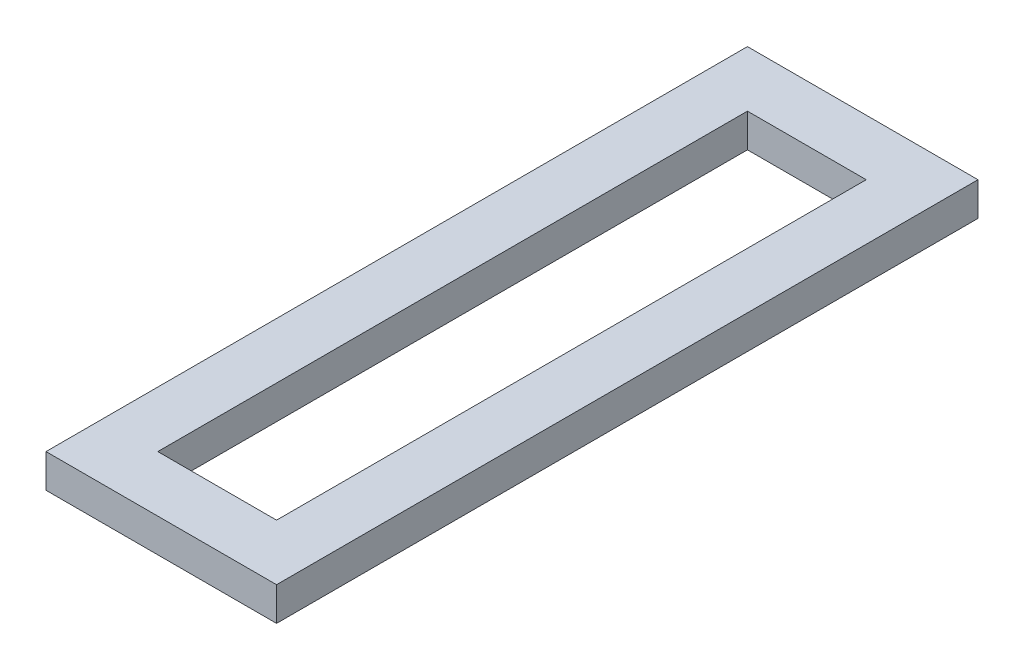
ISO-10303-21;
HEADER;
FILE_DESCRIPTION(('STEP AP214'),'2;1');
FILE_NAME('part.step','',(''),(''),'','','');
FILE_SCHEMA(('AUTOMOTIVE_DESIGN { 1 0 10303 214 1 1 1 1 }'));
ENDSEC;
DATA;
#1=APPLICATION_CONTEXT('core data for automotive mechanical design processes');
#2=APPLICATION_PROTOCOL_DEFINITION('international standard','automotive_design',2000,#1);
#3=PRODUCT_CONTEXT('',#1,'mechanical');
#4=PRODUCT('Part','Part','',(#3));
#5=PRODUCT_RELATED_PRODUCT_CATEGORY('part','',(#4));
#6=PRODUCT_DEFINITION_FORMATION('','',#4);
#7=PRODUCT_DEFINITION_CONTEXT('part definition',#1,'design');
#8=PRODUCT_DEFINITION('design','',#6,#7);
#9=PRODUCT_DEFINITION_SHAPE('','',#8);
#10=(LENGTH_UNIT() NAMED_UNIT(*) SI_UNIT(.MILLI.,.METRE.));
#11=(NAMED_UNIT(*) PLANE_ANGLE_UNIT() SI_UNIT($,.RADIAN.));
#12=(NAMED_UNIT(*) SI_UNIT($,.STERADIAN.) SOLID_ANGLE_UNIT());
#13=UNCERTAINTY_MEASURE_WITH_UNIT(LENGTH_MEASURE(1.E-05),#10,'distance_accuracy_value','');
#14=(GEOMETRIC_REPRESENTATION_CONTEXT(3) GLOBAL_UNCERTAINTY_ASSIGNED_CONTEXT((#13)) GLOBAL_UNIT_ASSIGNED_CONTEXT((#10,
#11,#12)) REPRESENTATION_CONTEXT('',''));
#15=CARTESIAN_POINT('',(0.,0.,0.));
#16=DIRECTION('',(0.,0.,1.));
#17=DIRECTION('',(1.,0.,0.));
#18=AXIS2_PLACEMENT_3D('',#15,#16,#17);
#19=CARTESIAN_POINT('',(0.,120.,0.));
#20=DIRECTION('',(0.,-1.,0.));
#21=DIRECTION('',(0.,0.,-1.));
#22=AXIS2_PLACEMENT_3D('',#19,#20,#21);
#23=PLANE('',#22);
#24=DIRECTION('',(0.,0.,-1.));
#25=VECTOR('',#24,1.);
#26=CARTESIAN_POINT('',(412.5,120.,1255.));
#27=LINE('',#26,#25);
#28=CARTESIAN_POINT('',(412.5,120.,1255.));
#29=VERTEX_POINT('',#28);
#30=CARTESIAN_POINT('',(412.5,120.,-1255.));
#31=VERTEX_POINT('',#30);
#32=EDGE_CURVE('E246',#29,#31,#27,.T.);
#33=ORIENTED_EDGE('',*,*,#32,.T.);
#34=DIRECTION('',(-1.,0.,0.));
#35=VECTOR('',#34,1.);
#36=CARTESIAN_POINT('',(-412.5,120.,-1255.));
#37=LINE('',#36,#35);
#38=CARTESIAN_POINT('',(-412.5,120.,-1255.));
#39=VERTEX_POINT('',#38);
#40=EDGE_CURVE('E249',#31,#39,#37,.T.);
#41=ORIENTED_EDGE('',*,*,#40,.T.);
#42=DIRECTION('',(0.,0.,1.));
#43=VECTOR('',#42,1.);
#44=CARTESIAN_POINT('',(-412.5,120.,1255.));
#45=LINE('',#44,#43);
#46=CARTESIAN_POINT('',(-412.5,120.,1255.));
#47=VERTEX_POINT('',#46);
#48=EDGE_CURVE('E252',#39,#47,#45,.T.);
#49=ORIENTED_EDGE('',*,*,#48,.T.);
#50=DIRECTION('',(1.,0.,0.));
#51=VECTOR('',#50,1.);
#52=CARTESIAN_POINT('',(-412.5,120.,1255.));
#53=LINE('',#52,#51);
#54=EDGE_CURVE('E254',#47,#29,#53,.T.);
#55=ORIENTED_EDGE('',*,*,#54,.T.);
#56=EDGE_LOOP('',(#33,#41,#49,#55));
#57=FACE_BOUND('',#56,.T.);
#58=DIRECTION('',(0.,0.,1.));
#59=VECTOR('',#58,1.);
#60=CARTESIAN_POINT('',(-212.5,120.,1055.));
#61=LINE('',#60,#59);
#62=CARTESIAN_POINT('',(-212.5,120.,-1055.));
#63=VERTEX_POINT('',#62);
#64=CARTESIAN_POINT('',(-212.5,120.,1055.));
#65=VERTEX_POINT('',#64);
#66=EDGE_CURVE('E220',#63,#65,#61,.T.);
#67=ORIENTED_EDGE('',*,*,#66,.F.);
#68=DIRECTION('',(-1.,0.,0.));
#69=VECTOR('',#68,1.);
#70=CARTESIAN_POINT('',(-212.5,120.,-1055.));
#71=LINE('',#70,#69);
#72=CARTESIAN_POINT('',(212.5,120.,-1055.));
#73=VERTEX_POINT('',#72);
#74=EDGE_CURVE('E227',#73,#63,#71,.T.);
#75=ORIENTED_EDGE('',*,*,#74,.F.);
#76=DIRECTION('',(0.,0.,-1.));
#77=VECTOR('',#76,1.);
#78=CARTESIAN_POINT('',(212.5,120.,1055.));
#79=LINE('',#78,#77);
#80=CARTESIAN_POINT('',(212.5,120.,1055.));
#81=VERTEX_POINT('',#80);
#82=EDGE_CURVE('E225',#81,#73,#79,.T.);
#83=ORIENTED_EDGE('',*,*,#82,.F.);
#84=DIRECTION('',(1.,0.,0.));
#85=VECTOR('',#84,1.);
#86=CARTESIAN_POINT('',(-212.5,120.,1055.));
#87=LINE('',#86,#85);
#88=EDGE_CURVE('E222',#65,#81,#87,.T.);
#89=ORIENTED_EDGE('',*,*,#88,.F.);
#90=EDGE_LOOP('',(#67,#75,#83,#89));
#91=FACE_BOUND('',#90,.T.);
#92=ADVANCED_FACE('F33',(#57,#91),#23,.F.);
#93=CARTESIAN_POINT('',(0.,0.,0.));
#94=DIRECTION('',(0.,-1.,0.));
#95=DIRECTION('',(0.,0.,-1.));
#96=AXIS2_PLACEMENT_3D('',#93,#94,#95);
#97=PLANE('',#96);
#98=DIRECTION('',(0.,0.,-1.));
#99=VECTOR('',#98,1.);
#100=CARTESIAN_POINT('',(412.5,0.,1255.));
#101=LINE('',#100,#99);
#102=CARTESIAN_POINT('',(412.5,0.,1255.));
#103=VERTEX_POINT('',#102);
#104=CARTESIAN_POINT('',(412.5,0.,-1255.));
#105=VERTEX_POINT('',#104);
#106=EDGE_CURVE('E245',#103,#105,#101,.T.);
#107=ORIENTED_EDGE('',*,*,#106,.F.);
#108=DIRECTION('',(1.,0.,0.));
#109=VECTOR('',#108,1.);
#110=CARTESIAN_POINT('',(-412.5,0.,1255.));
#111=LINE('',#110,#109);
#112=CARTESIAN_POINT('',(-412.5,0.,1255.));
#113=VERTEX_POINT('',#112);
#114=EDGE_CURVE('E250',#113,#103,#111,.T.);
#115=ORIENTED_EDGE('',*,*,#114,.F.);
#116=DIRECTION('',(0.,0.,1.));
#117=VECTOR('',#116,1.);
#118=CARTESIAN_POINT('',(-412.5,0.,1255.));
#119=LINE('',#118,#117);
#120=CARTESIAN_POINT('',(-412.5,0.,-1255.));
#121=VERTEX_POINT('',#120);
#122=EDGE_CURVE('E261',#121,#113,#119,.T.);
#123=ORIENTED_EDGE('',*,*,#122,.F.);
#124=DIRECTION('',(-1.,0.,0.));
#125=VECTOR('',#124,1.);
#126=CARTESIAN_POINT('',(-412.5,0.,-1255.));
#127=LINE('',#126,#125);
#128=EDGE_CURVE('E259',#105,#121,#127,.T.);
#129=ORIENTED_EDGE('',*,*,#128,.F.);
#130=EDGE_LOOP('',(#107,#115,#123,#129));
#131=FACE_BOUND('',#130,.T.);
#132=DIRECTION('',(-1.,0.,0.));
#133=VECTOR('',#132,1.);
#134=CARTESIAN_POINT('',(-212.5,0.,-1055.));
#135=LINE('',#134,#133);
#136=CARTESIAN_POINT('',(212.5,0.,-1055.));
#137=VERTEX_POINT('',#136);
#138=CARTESIAN_POINT('',(-212.5,0.,-1055.));
#139=VERTEX_POINT('',#138);
#140=EDGE_CURVE('E223',#137,#139,#135,.T.);
#141=ORIENTED_EDGE('',*,*,#140,.T.);
#142=DIRECTION('',(0.,0.,1.));
#143=VECTOR('',#142,1.);
#144=CARTESIAN_POINT('',(-212.5,0.,1055.));
#145=LINE('',#144,#143);
#146=CARTESIAN_POINT('',(-212.5,0.,1055.));
#147=VERTEX_POINT('',#146);
#148=EDGE_CURVE('E56',#139,#147,#145,.T.);
#149=ORIENTED_EDGE('',*,*,#148,.T.);
#150=DIRECTION('',(1.,0.,0.));
#151=VECTOR('',#150,1.);
#152=CARTESIAN_POINT('',(-212.5,0.,1055.));
#153=LINE('',#152,#151);
#154=CARTESIAN_POINT('',(212.5,0.,1055.));
#155=VERTEX_POINT('',#154);
#156=EDGE_CURVE('E231',#147,#155,#153,.T.);
#157=ORIENTED_EDGE('',*,*,#156,.T.);
#158=DIRECTION('',(0.,0.,-1.));
#159=VECTOR('',#158,1.);
#160=CARTESIAN_POINT('',(212.5,0.,1055.));
#161=LINE('',#160,#159);
#162=EDGE_CURVE('E234',#155,#137,#161,.T.);
#163=ORIENTED_EDGE('',*,*,#162,.T.);
#164=EDGE_LOOP('',(#141,#149,#157,#163));
#165=FACE_BOUND('',#164,.T.);
#166=ADVANCED_FACE('F279',(#131,#165),#97,.T.);
#167=CARTESIAN_POINT('',(412.5,120.,1255.));
#168=DIRECTION('',(-1.,0.,0.));
#169=DIRECTION('',(0.,0.,1.));
#170=AXIS2_PLACEMENT_3D('',#167,#168,#169);
#171=PLANE('',#170);
#172=ORIENTED_EDGE('',*,*,#106,.T.);
#173=DIRECTION('',(0.,-1.,0.));
#174=VECTOR('',#173,1.);
#175=CARTESIAN_POINT('',(412.5,120.,-1255.));
#176=LINE('',#175,#174);
#177=EDGE_CURVE('E11',#31,#105,#176,.T.);
#178=ORIENTED_EDGE('',*,*,#177,.F.);
#179=ORIENTED_EDGE('',*,*,#32,.F.);
#180=DIRECTION('',(0.,-1.,0.));
#181=VECTOR('',#180,1.);
#182=CARTESIAN_POINT('',(412.5,120.,1255.));
#183=LINE('',#182,#181);
#184=EDGE_CURVE('E256',#29,#103,#183,.T.);
#185=ORIENTED_EDGE('',*,*,#184,.T.);
#186=EDGE_LOOP('',(#172,#178,#179,#185));
#187=FACE_BOUND('',#186,.T.);
#188=ADVANCED_FACE('F35',(#187),#171,.F.);
#189=CARTESIAN_POINT('',(-412.5,120.,-1255.));
#190=DIRECTION('',(0.,0.,1.));
#191=DIRECTION('',(1.,0.,0.));
#192=AXIS2_PLACEMENT_3D('',#189,#190,#191);
#193=PLANE('',#192);
#194=ORIENTED_EDGE('',*,*,#128,.T.);
#195=DIRECTION('',(0.,-1.,0.));
#196=VECTOR('',#195,1.);
#197=CARTESIAN_POINT('',(-412.5,120.,-1255.));
#198=LINE('',#197,#196);
#199=EDGE_CURVE('E41',#39,#121,#198,.T.);
#200=ORIENTED_EDGE('',*,*,#199,.F.);
#201=ORIENTED_EDGE('',*,*,#40,.F.);
#202=ORIENTED_EDGE('',*,*,#177,.T.);
#203=EDGE_LOOP('',(#194,#200,#201,#202));
#204=FACE_BOUND('',#203,.T.);
#205=ADVANCED_FACE('F290',(#204),#193,.F.);
#206=CARTESIAN_POINT('',(-412.5,120.,1255.));
#207=DIRECTION('',(1.,0.,0.));
#208=DIRECTION('',(0.,0.,-1.));
#209=AXIS2_PLACEMENT_3D('',#206,#207,#208);
#210=PLANE('',#209);
#211=ORIENTED_EDGE('',*,*,#122,.T.);
#212=DIRECTION('',(0.,-1.,0.));
#213=VECTOR('',#212,1.);
#214=CARTESIAN_POINT('',(-412.5,120.,1255.));
#215=LINE('',#214,#213);
#216=EDGE_CURVE('E266',#47,#113,#215,.T.);
#217=ORIENTED_EDGE('',*,*,#216,.F.);
#218=ORIENTED_EDGE('',*,*,#48,.F.);
#219=ORIENTED_EDGE('',*,*,#199,.T.);
#220=EDGE_LOOP('',(#211,#217,#218,#219));
#221=FACE_BOUND('',#220,.T.);
#222=ADVANCED_FACE('F273',(#221),#210,.F.);
#223=CARTESIAN_POINT('',(-412.5,120.,1255.));
#224=DIRECTION('',(0.,0.,-1.));
#225=DIRECTION('',(-1.,0.,0.));
#226=AXIS2_PLACEMENT_3D('',#223,#224,#225);
#227=PLANE('',#226);
#228=ORIENTED_EDGE('',*,*,#114,.T.);
#229=ORIENTED_EDGE('',*,*,#184,.F.);
#230=ORIENTED_EDGE('',*,*,#54,.F.);
#231=ORIENTED_EDGE('',*,*,#216,.T.);
#232=EDGE_LOOP('',(#228,#229,#230,#231));
#233=FACE_BOUND('',#232,.T.);
#234=ADVANCED_FACE('F283',(#233),#227,.F.);
#235=CARTESIAN_POINT('',(-212.5,120.,1055.));
#236=DIRECTION('',(1.,0.,0.));
#237=DIRECTION('',(0.,0.,-1.));
#238=AXIS2_PLACEMENT_3D('',#235,#236,#237);
#239=PLANE('',#238);
#240=ORIENTED_EDGE('',*,*,#148,.F.);
#241=DIRECTION('',(0.,-1.,0.));
#242=VECTOR('',#241,1.);
#243=CARTESIAN_POINT('',(-212.5,120.,-1055.));
#244=LINE('',#243,#242);
#245=EDGE_CURVE('E229',#63,#139,#244,.T.);
#246=ORIENTED_EDGE('',*,*,#245,.F.);
#247=ORIENTED_EDGE('',*,*,#66,.T.);
#248=DIRECTION('',(0.,-1.,0.));
#249=VECTOR('',#248,1.);
#250=CARTESIAN_POINT('',(-212.5,120.,1055.));
#251=LINE('',#250,#249);
#252=EDGE_CURVE('E243',#65,#147,#251,.T.);
#253=ORIENTED_EDGE('',*,*,#252,.T.);
#254=EDGE_LOOP('',(#240,#246,#247,#253));
#255=FACE_BOUND('',#254,.T.);
#256=ADVANCED_FACE('F304',(#255),#239,.T.);
#257=CARTESIAN_POINT('',(-212.5,120.,1055.));
#258=DIRECTION('',(0.,0.,-1.));
#259=DIRECTION('',(-1.,0.,0.));
#260=AXIS2_PLACEMENT_3D('',#257,#258,#259);
#261=PLANE('',#260);
#262=ORIENTED_EDGE('',*,*,#156,.F.);
#263=ORIENTED_EDGE('',*,*,#252,.F.);
#264=ORIENTED_EDGE('',*,*,#88,.T.);
#265=DIRECTION('',(0.,-1.,0.));
#266=VECTOR('',#265,1.);
#267=CARTESIAN_POINT('',(212.5,120.,1055.));
#268=LINE('',#267,#266);
#269=EDGE_CURVE('E241',#81,#155,#268,.T.);
#270=ORIENTED_EDGE('',*,*,#269,.T.);
#271=EDGE_LOOP('',(#262,#263,#264,#270));
#272=FACE_BOUND('',#271,.T.);
#273=ADVANCED_FACE('F311',(#272),#261,.T.);
#274=CARTESIAN_POINT('',(212.5,120.,1055.));
#275=DIRECTION('',(-1.,0.,0.));
#276=DIRECTION('',(0.,0.,1.));
#277=AXIS2_PLACEMENT_3D('',#274,#275,#276);
#278=PLANE('',#277);
#279=ORIENTED_EDGE('',*,*,#162,.F.);
#280=ORIENTED_EDGE('',*,*,#269,.F.);
#281=ORIENTED_EDGE('',*,*,#82,.T.);
#282=DIRECTION('',(0.,-1.,0.));
#283=VECTOR('',#282,1.);
#284=CARTESIAN_POINT('',(212.5,120.,-1055.));
#285=LINE('',#284,#283);
#286=EDGE_CURVE('E48',#73,#137,#285,.T.);
#287=ORIENTED_EDGE('',*,*,#286,.T.);
#288=EDGE_LOOP('',(#279,#280,#281,#287));
#289=FACE_BOUND('',#288,.T.);
#290=ADVANCED_FACE('F315',(#289),#278,.T.);
#291=CARTESIAN_POINT('',(-212.5,120.,-1055.));
#292=DIRECTION('',(0.,0.,1.));
#293=DIRECTION('',(1.,0.,0.));
#294=AXIS2_PLACEMENT_3D('',#291,#292,#293);
#295=PLANE('',#294);
#296=ORIENTED_EDGE('',*,*,#140,.F.);
#297=ORIENTED_EDGE('',*,*,#286,.F.);
#298=ORIENTED_EDGE('',*,*,#74,.T.);
#299=ORIENTED_EDGE('',*,*,#245,.T.);
#300=EDGE_LOOP('',(#296,#297,#298,#299));
#301=FACE_BOUND('',#300,.T.);
#302=ADVANCED_FACE('F320',(#301),#295,.T.);
#303=CLOSED_SHELL('',(#92,#166,#188,#205,#222,#234,#256,#273,#290,#302));
#304=CARTESIAN_POINT('',(0.,110.,0.));
#305=DIRECTION('',(0.,-1.,0.));
#306=DIRECTION('',(0.,0.,-1.));
#307=AXIS2_PLACEMENT_3D('',#304,#305,#306);
#308=PLANE('',#307);
#309=DIRECTION('',(0.,0.,-1.));
#310=VECTOR('',#309,1.);
#311=CARTESIAN_POINT('',(402.5,110.,1245.));
#312=LINE('',#311,#310);
#313=CARTESIAN_POINT('',(402.5,110.,1245.));
#314=VERTEX_POINT('',#313);
#315=CARTESIAN_POINT('',(402.5,110.,-1245.));
#316=VERTEX_POINT('',#315);
#317=EDGE_CURVE('E191',#314,#316,#312,.T.);
#318=ORIENTED_EDGE('',*,*,#317,.F.);
#319=DIRECTION('',(1.,0.,0.));
#320=VECTOR('',#319,1.);
#321=CARTESIAN_POINT('',(-402.5,110.,1245.));
#322=LINE('',#321,#320);
#323=CARTESIAN_POINT('',(-402.5,110.,1245.));
#324=VERTEX_POINT('',#323);
#325=EDGE_CURVE('E199',#324,#314,#322,.T.);
#326=ORIENTED_EDGE('',*,*,#325,.F.);
#327=DIRECTION('',(0.,0.,1.));
#328=VECTOR('',#327,1.);
#329=CARTESIAN_POINT('',(-402.5,110.,1245.));
#330=LINE('',#329,#328);
#331=CARTESIAN_POINT('',(-402.5,110.,-1245.));
#332=VERTEX_POINT('',#331);
#333=EDGE_CURVE('E197',#332,#324,#330,.T.);
#334=ORIENTED_EDGE('',*,*,#333,.F.);
#335=DIRECTION('',(-1.,0.,0.));
#336=VECTOR('',#335,1.);
#337=CARTESIAN_POINT('',(-402.5,110.,-1245.));
#338=LINE('',#337,#336);
#339=EDGE_CURVE('E194',#316,#332,#338,.T.);
#340=ORIENTED_EDGE('',*,*,#339,.F.);
#341=EDGE_LOOP('',(#318,#326,#334,#340));
#342=FACE_BOUND('',#341,.T.);
#343=DIRECTION('',(0.,0.,1.));
#344=VECTOR('',#343,1.);
#345=CARTESIAN_POINT('',(-222.5,110.,1065.));
#346=LINE('',#345,#344);
#347=CARTESIAN_POINT('',(-222.5,110.,-1065.));
#348=VERTEX_POINT('',#347);
#349=CARTESIAN_POINT('',(-222.5,110.,1065.));
#350=VERTEX_POINT('',#349);
#351=EDGE_CURVE('E147',#348,#350,#346,.T.);
#352=ORIENTED_EDGE('',*,*,#351,.T.);
#353=DIRECTION('',(1.,0.,0.));
#354=VECTOR('',#353,1.);
#355=CARTESIAN_POINT('',(222.5,110.,1065.));
#356=LINE('',#355,#354);
#357=CARTESIAN_POINT('',(222.5,110.,1065.));
#358=VERTEX_POINT('',#357);
#359=EDGE_CURVE('E152',#350,#358,#356,.T.);
#360=ORIENTED_EDGE('',*,*,#359,.T.);
#361=DIRECTION('',(0.,0.,-1.));
#362=VECTOR('',#361,1.);
#363=CARTESIAN_POINT('',(222.5,110.,1065.));
#364=LINE('',#363,#362);
#365=CARTESIAN_POINT('',(222.5,110.,-1065.));
#366=VERTEX_POINT('',#365);
#367=EDGE_CURVE('E173',#358,#366,#364,.T.);
#368=ORIENTED_EDGE('',*,*,#367,.T.);
#369=DIRECTION('',(-1.,0.,0.));
#370=VECTOR('',#369,1.);
#371=CARTESIAN_POINT('',(222.5,110.,-1065.));
#372=LINE('',#371,#370);
#373=EDGE_CURVE('E155',#366,#348,#372,.T.);
#374=ORIENTED_EDGE('',*,*,#373,.T.);
#375=EDGE_LOOP('',(#352,#360,#368,#374));
#376=FACE_BOUND('',#375,.T.);
#377=ADVANCED_FACE('F149',(#342,#376),#308,.T.);
#378=CARTESIAN_POINT('',(0.,10.,0.));
#379=DIRECTION('',(0.,-1.,0.));
#380=DIRECTION('',(0.,0.,-1.));
#381=AXIS2_PLACEMENT_3D('',#378,#379,#380);
#382=PLANE('',#381);
#383=DIRECTION('',(0.,0.,-1.));
#384=VECTOR('',#383,1.);
#385=CARTESIAN_POINT('',(402.5,10.,1245.));
#386=LINE('',#385,#384);
#387=CARTESIAN_POINT('',(402.5,10.,1245.));
#388=VERTEX_POINT('',#387);
#389=CARTESIAN_POINT('',(402.5,10.,-1245.));
#390=VERTEX_POINT('',#389);
#391=EDGE_CURVE('E168',#388,#390,#386,.T.);
#392=ORIENTED_EDGE('',*,*,#391,.T.);
#393=DIRECTION('',(-1.,0.,0.));
#394=VECTOR('',#393,1.);
#395=CARTESIAN_POINT('',(-402.5,10.,-1245.));
#396=LINE('',#395,#394);
#397=CARTESIAN_POINT('',(-402.5,10.,-1245.));
#398=VERTEX_POINT('',#397);
#399=EDGE_CURVE('E204',#390,#398,#396,.T.);
#400=ORIENTED_EDGE('',*,*,#399,.T.);
#401=DIRECTION('',(0.,0.,1.));
#402=VECTOR('',#401,1.);
#403=CARTESIAN_POINT('',(-402.5,10.,1245.));
#404=LINE('',#403,#402);
#405=CARTESIAN_POINT('',(-402.5,10.,1245.));
#406=VERTEX_POINT('',#405);
#407=EDGE_CURVE('E206',#398,#406,#404,.T.);
#408=ORIENTED_EDGE('',*,*,#407,.T.);
#409=DIRECTION('',(1.,0.,0.));
#410=VECTOR('',#409,1.);
#411=CARTESIAN_POINT('',(-402.5,10.,1245.));
#412=LINE('',#411,#410);
#413=EDGE_CURVE('E195',#406,#388,#412,.T.);
#414=ORIENTED_EDGE('',*,*,#413,.T.);
#415=EDGE_LOOP('',(#392,#400,#408,#414));
#416=FACE_BOUND('',#415,.T.);
#417=DIRECTION('',(-1.,0.,0.));
#418=VECTOR('',#417,1.);
#419=CARTESIAN_POINT('',(222.5,10.,-1065.));
#420=LINE('',#419,#418);
#421=CARTESIAN_POINT('',(222.5,10.,-1065.));
#422=VERTEX_POINT('',#421);
#423=CARTESIAN_POINT('',(-222.5,10.,-1065.));
#424=VERTEX_POINT('',#423);
#425=EDGE_CURVE('E159',#422,#424,#420,.T.);
#426=ORIENTED_EDGE('',*,*,#425,.F.);
#427=DIRECTION('',(0.,0.,-1.));
#428=VECTOR('',#427,1.);
#429=CARTESIAN_POINT('',(222.5,10.,1065.));
#430=LINE('',#429,#428);
#431=CARTESIAN_POINT('',(222.5,10.,1065.));
#432=VERTEX_POINT('',#431);
#433=EDGE_CURVE('E182',#432,#422,#430,.T.);
#434=ORIENTED_EDGE('',*,*,#433,.F.);
#435=DIRECTION('',(1.,0.,0.));
#436=VECTOR('',#435,1.);
#437=CARTESIAN_POINT('',(222.5,10.,1065.));
#438=LINE('',#437,#436);
#439=CARTESIAN_POINT('',(-222.5,10.,1065.));
#440=VERTEX_POINT('',#439);
#441=EDGE_CURVE('E180',#440,#432,#438,.T.);
#442=ORIENTED_EDGE('',*,*,#441,.F.);
#443=DIRECTION('',(0.,0.,1.));
#444=VECTOR('',#443,1.);
#445=CARTESIAN_POINT('',(-222.5,10.,1065.));
#446=LINE('',#445,#444);
#447=EDGE_CURVE('E165',#424,#440,#446,.T.);
#448=ORIENTED_EDGE('',*,*,#447,.F.);
#449=EDGE_LOOP('',(#426,#434,#442,#448));
#450=FACE_BOUND('',#449,.T.);
#451=ADVANCED_FACE('F330',(#416,#450),#382,.F.);
#452=CARTESIAN_POINT('',(402.5,110.,1245.));
#453=DIRECTION('',(-1.,0.,0.));
#454=DIRECTION('',(0.,0.,1.));
#455=AXIS2_PLACEMENT_3D('',#452,#453,#454);
#456=PLANE('',#455);
#457=ORIENTED_EDGE('',*,*,#391,.F.);
#458=DIRECTION('',(0.,-1.,0.));
#459=VECTOR('',#458,1.);
#460=CARTESIAN_POINT('',(402.5,110.,1245.));
#461=LINE('',#460,#459);
#462=EDGE_CURVE('E201',#314,#388,#461,.T.);
#463=ORIENTED_EDGE('',*,*,#462,.F.);
#464=ORIENTED_EDGE('',*,*,#317,.T.);
#465=DIRECTION('',(0.,-1.,0.));
#466=VECTOR('',#465,1.);
#467=CARTESIAN_POINT('',(402.5,110.,-1245.));
#468=LINE('',#467,#466);
#469=EDGE_CURVE('E217',#316,#390,#468,.T.);
#470=ORIENTED_EDGE('',*,*,#469,.T.);
#471=EDGE_LOOP('',(#457,#463,#464,#470));
#472=FACE_BOUND('',#471,.T.);
#473=ADVANCED_FACE('F326',(#472),#456,.T.);
#474=CARTESIAN_POINT('',(-402.5,110.,-1245.));
#475=DIRECTION('',(0.,0.,1.));
#476=DIRECTION('',(1.,0.,0.));
#477=AXIS2_PLACEMENT_3D('',#474,#475,#476);
#478=PLANE('',#477);
#479=ORIENTED_EDGE('',*,*,#399,.F.);
#480=ORIENTED_EDGE('',*,*,#469,.F.);
#481=ORIENTED_EDGE('',*,*,#339,.T.);
#482=DIRECTION('',(0.,-1.,0.));
#483=VECTOR('',#482,1.);
#484=CARTESIAN_POINT('',(-402.5,110.,-1245.));
#485=LINE('',#484,#483);
#486=EDGE_CURVE('E214',#332,#398,#485,.T.);
#487=ORIENTED_EDGE('',*,*,#486,.T.);
#488=EDGE_LOOP('',(#479,#480,#481,#487));
#489=FACE_BOUND('',#488,.T.);
#490=ADVANCED_FACE('F329',(#489),#478,.T.);
#491=CARTESIAN_POINT('',(-402.5,110.,1245.));
#492=DIRECTION('',(1.,0.,0.));
#493=DIRECTION('',(0.,0.,-1.));
#494=AXIS2_PLACEMENT_3D('',#491,#492,#493);
#495=PLANE('',#494);
#496=ORIENTED_EDGE('',*,*,#407,.F.);
#497=ORIENTED_EDGE('',*,*,#486,.F.);
#498=ORIENTED_EDGE('',*,*,#333,.T.);
#499=DIRECTION('',(0.,-1.,0.));
#500=VECTOR('',#499,1.);
#501=CARTESIAN_POINT('',(-402.5,110.,1245.));
#502=LINE('',#501,#500);
#503=EDGE_CURVE('E211',#324,#406,#502,.T.);
#504=ORIENTED_EDGE('',*,*,#503,.T.);
#505=EDGE_LOOP('',(#496,#497,#498,#504));
#506=FACE_BOUND('',#505,.T.);
#507=ADVANCED_FACE('F335',(#506),#495,.T.);
#508=CARTESIAN_POINT('',(-402.5,110.,1245.));
#509=DIRECTION('',(0.,0.,-1.));
#510=DIRECTION('',(-1.,0.,0.));
#511=AXIS2_PLACEMENT_3D('',#508,#509,#510);
#512=PLANE('',#511);
#513=ORIENTED_EDGE('',*,*,#413,.F.);
#514=ORIENTED_EDGE('',*,*,#503,.F.);
#515=ORIENTED_EDGE('',*,*,#325,.T.);
#516=ORIENTED_EDGE('',*,*,#462,.T.);
#517=EDGE_LOOP('',(#513,#514,#515,#516));
#518=FACE_BOUND('',#517,.T.);
#519=ADVANCED_FACE('F339',(#518),#512,.T.);
#520=CARTESIAN_POINT('',(-222.5,110.,1065.));
#521=DIRECTION('',(1.,0.,0.));
#522=DIRECTION('',(0.,0.,-1.));
#523=AXIS2_PLACEMENT_3D('',#520,#521,#522);
#524=PLANE('',#523);
#525=ORIENTED_EDGE('',*,*,#447,.T.);
#526=DIRECTION('',(0.,-1.,0.));
#527=VECTOR('',#526,1.);
#528=CARTESIAN_POINT('',(-222.5,110.,1065.));
#529=LINE('',#528,#527);
#530=EDGE_CURVE('E163',#350,#440,#529,.T.);
#531=ORIENTED_EDGE('',*,*,#530,.F.);
#532=ORIENTED_EDGE('',*,*,#351,.F.);
#533=DIRECTION('',(0.,-1.,0.));
#534=VECTOR('',#533,1.);
#535=CARTESIAN_POINT('',(-222.5,110.,-1065.));
#536=LINE('',#535,#534);
#537=EDGE_CURVE('E178',#348,#424,#536,.T.);
#538=ORIENTED_EDGE('',*,*,#537,.T.);
#539=EDGE_LOOP('',(#525,#531,#532,#538));
#540=FACE_BOUND('',#539,.T.);
#541=ADVANCED_FACE('F164',(#540),#524,.F.);
#542=CARTESIAN_POINT('',(222.5,110.,1065.));
#543=DIRECTION('',(0.,0.,-1.));
#544=DIRECTION('',(-1.,0.,0.));
#545=AXIS2_PLACEMENT_3D('',#542,#543,#544);
#546=PLANE('',#545);
#547=ORIENTED_EDGE('',*,*,#441,.T.);
#548=DIRECTION('',(0.,-1.,0.));
#549=VECTOR('',#548,1.);
#550=CARTESIAN_POINT('',(222.5,110.,1065.));
#551=LINE('',#550,#549);
#552=EDGE_CURVE('E169',#358,#432,#551,.T.);
#553=ORIENTED_EDGE('',*,*,#552,.F.);
#554=ORIENTED_EDGE('',*,*,#359,.F.);
#555=ORIENTED_EDGE('',*,*,#530,.T.);
#556=EDGE_LOOP('',(#547,#553,#554,#555));
#557=FACE_BOUND('',#556,.T.);
#558=ADVANCED_FACE('F171',(#557),#546,.F.);
#559=CARTESIAN_POINT('',(222.5,110.,1065.));
#560=DIRECTION('',(-1.,0.,0.));
#561=DIRECTION('',(0.,0.,1.));
#562=AXIS2_PLACEMENT_3D('',#559,#560,#561);
#563=PLANE('',#562);
#564=ORIENTED_EDGE('',*,*,#433,.T.);
#565=DIRECTION('',(0.,-1.,0.));
#566=VECTOR('',#565,1.);
#567=CARTESIAN_POINT('',(222.5,110.,-1065.));
#568=LINE('',#567,#566);
#569=EDGE_CURVE('E188',#366,#422,#568,.T.);
#570=ORIENTED_EDGE('',*,*,#569,.F.);
#571=ORIENTED_EDGE('',*,*,#367,.F.);
#572=ORIENTED_EDGE('',*,*,#552,.T.);
#573=EDGE_LOOP('',(#564,#570,#571,#572));
#574=FACE_BOUND('',#573,.T.);
#575=ADVANCED_FACE('F354',(#574),#563,.F.);
#576=CARTESIAN_POINT('',(222.5,110.,-1065.));
#577=DIRECTION('',(0.,0.,1.));
#578=DIRECTION('',(1.,0.,0.));
#579=AXIS2_PLACEMENT_3D('',#576,#577,#578);
#580=PLANE('',#579);
#581=ORIENTED_EDGE('',*,*,#425,.T.);
#582=ORIENTED_EDGE('',*,*,#537,.F.);
#583=ORIENTED_EDGE('',*,*,#373,.F.);
#584=ORIENTED_EDGE('',*,*,#569,.T.);
#585=EDGE_LOOP('',(#581,#582,#583,#584));
#586=FACE_BOUND('',#585,.T.);
#587=ADVANCED_FACE('F357',(#586),#580,.F.);
#588=CLOSED_SHELL('',(#377,#451,#473,#490,#507,#519,#541,#558,#575,#587));
#589=ORIENTED_CLOSED_SHELL('',*,#588,.T.);
#590=BREP_WITH_VOIDS('B2',#303,(#589));
#591=ADVANCED_BREP_SHAPE_REPRESENTATION('',(#18,#590),#14);
#592=SHAPE_DEFINITION_REPRESENTATION(#9,#591);
ENDSEC;
END-ISO-10303-21;
